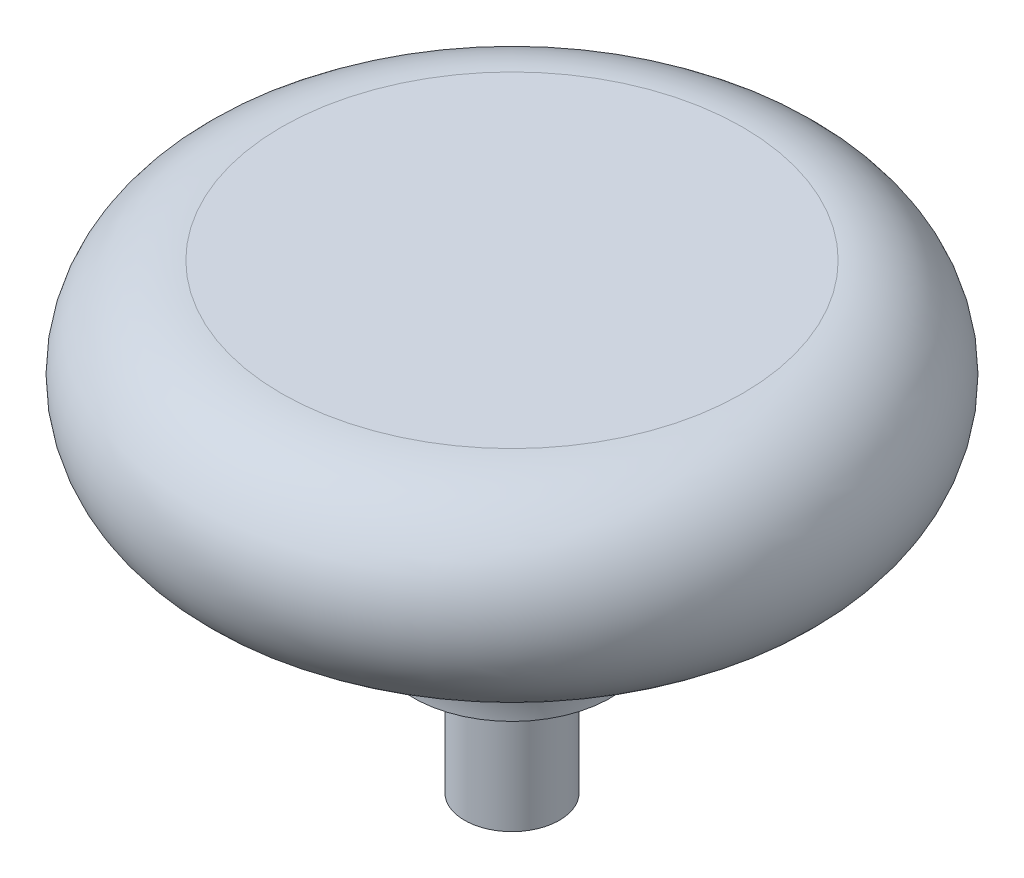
from build123d import *


with BuildPart() as part:
    # Sketch1 → Base-Revolve (revolve)
    with BuildSketch(Plane.XY, mode=Mode.PRIVATE) as base_revolve_sk:
        with BuildLine():
            Line((0, 0), (0, 22.225))
            Line((0, 22.225), (11.1125, 22.225))
            ThreePointArc((11.1125, 22.225), (15.875, 17.4625), (11.1125, 12.7))
            ThreePointArc((11.1125, 12.7), (6.622371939, 10.840128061), (4.7625, 6.35))
            Line((4.7625, 6.35), (2.286, 6.35))
            Line((2.286, 6.35), (2.286, 0))
            Line((2.286, 0), (0, 0))
        make_face()
    revolve(base_revolve_sk.sketch.rotate(Axis((0, 0, 0), (0, 1, 0)), 90), axis=Axis((0, 0, 0), (0, 1, 0)))


solid = part.part
